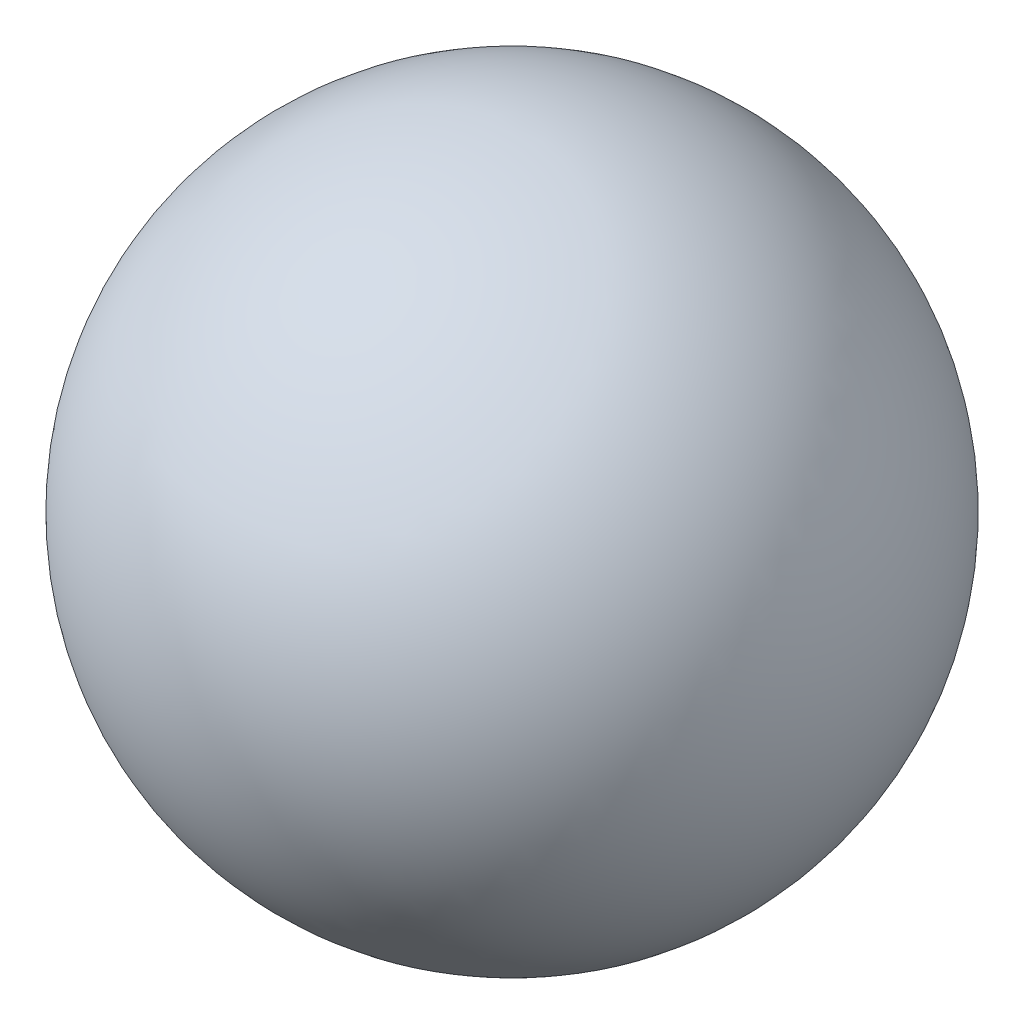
ISO-10303-21;
HEADER;
FILE_DESCRIPTION(('STEP AP214'),'2;1');
FILE_NAME('part.step','',(''),(''),'','','');
FILE_SCHEMA(('AUTOMOTIVE_DESIGN { 1 0 10303 214 1 1 1 1 }'));
ENDSEC;
DATA;
#1=APPLICATION_CONTEXT('core data for automotive mechanical design processes');
#2=APPLICATION_PROTOCOL_DEFINITION('international standard','automotive_design',2000,#1);
#3=PRODUCT_CONTEXT('',#1,'mechanical');
#4=PRODUCT('Part','Part','',(#3));
#5=PRODUCT_RELATED_PRODUCT_CATEGORY('part','',(#4));
#6=PRODUCT_DEFINITION_FORMATION('','',#4);
#7=PRODUCT_DEFINITION_CONTEXT('part definition',#1,'design');
#8=PRODUCT_DEFINITION('design','',#6,#7);
#9=PRODUCT_DEFINITION_SHAPE('','',#8);
#10=(LENGTH_UNIT() NAMED_UNIT(*) SI_UNIT(.MILLI.,.METRE.));
#11=(NAMED_UNIT(*) PLANE_ANGLE_UNIT() SI_UNIT($,.RADIAN.));
#12=(NAMED_UNIT(*) SI_UNIT($,.STERADIAN.) SOLID_ANGLE_UNIT());
#13=UNCERTAINTY_MEASURE_WITH_UNIT(LENGTH_MEASURE(1.E-05),#10,'distance_accuracy_value','');
#14=(GEOMETRIC_REPRESENTATION_CONTEXT(3) GLOBAL_UNCERTAINTY_ASSIGNED_CONTEXT((#13)) GLOBAL_UNIT_ASSIGNED_CONTEXT((#10,
#11,#12)) REPRESENTATION_CONTEXT('',''));
#15=CARTESIAN_POINT('',(0.,0.,0.));
#16=DIRECTION('',(0.,0.,1.));
#17=DIRECTION('',(1.,0.,0.));
#18=AXIS2_PLACEMENT_3D('',#15,#16,#17);
#19=CARTESIAN_POINT('',(0.,0.,0.));
#20=DIRECTION('',(0.,1.,0.));
#21=DIRECTION('',(1.,0.,0.));
#22=AXIS2_PLACEMENT_3D('',#19,#20,#21);
#23=SPHERICAL_SURFACE('',#22,86.25);
#24=CARTESIAN_POINT('',(0.,86.25,0.));
#25=VERTEX_POINT('',#24);
#26=VERTEX_LOOP('',#25);
#27=FACE_BOUND('',#26,.T.);
#28=ADVANCED_FACE('F31',(#27),#23,.T.);
#29=CLOSED_SHELL('',(#28));
#30=MANIFOLD_SOLID_BREP('B2',#29);
#31=ADVANCED_BREP_SHAPE_REPRESENTATION('',(#18,#30),#14);
#32=SHAPE_DEFINITION_REPRESENTATION(#9,#31);
ENDSEC;
END-ISO-10303-21;
